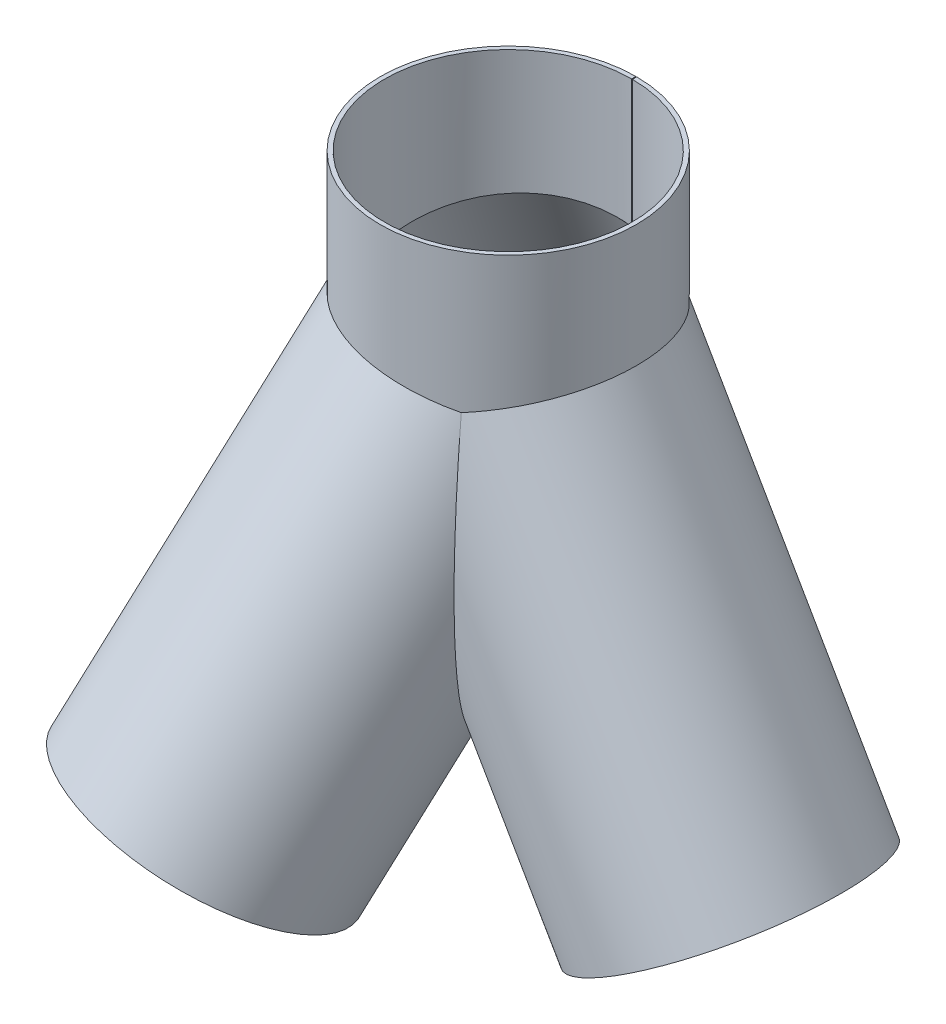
ISO-10303-21;
HEADER;
FILE_DESCRIPTION(('STEP AP214'),'2;1');
FILE_NAME('part.step','',(''),(''),'','','');
FILE_SCHEMA(('AUTOMOTIVE_DESIGN { 1 0 10303 214 1 1 1 1 }'));
ENDSEC;
DATA;
#1=APPLICATION_CONTEXT('core data for automotive mechanical design processes');
#2=APPLICATION_PROTOCOL_DEFINITION('international standard','automotive_design',2000,#1);
#3=PRODUCT_CONTEXT('',#1,'mechanical');
#4=PRODUCT('Part','Part','',(#3));
#5=PRODUCT_RELATED_PRODUCT_CATEGORY('part','',(#4));
#6=PRODUCT_DEFINITION_FORMATION('','',#4);
#7=PRODUCT_DEFINITION_CONTEXT('part definition',#1,'design');
#8=PRODUCT_DEFINITION('design','',#6,#7);
#9=PRODUCT_DEFINITION_SHAPE('','',#8);
#10=(LENGTH_UNIT() NAMED_UNIT(*) SI_UNIT(.MILLI.,.METRE.));
#11=(NAMED_UNIT(*) PLANE_ANGLE_UNIT() SI_UNIT($,.RADIAN.));
#12=(NAMED_UNIT(*) SI_UNIT($,.STERADIAN.) SOLID_ANGLE_UNIT());
#13=UNCERTAINTY_MEASURE_WITH_UNIT(LENGTH_MEASURE(1.E-05),#10,'distance_accuracy_value','');
#14=(GEOMETRIC_REPRESENTATION_CONTEXT(3) GLOBAL_UNCERTAINTY_ASSIGNED_CONTEXT((#13)) GLOBAL_UNIT_ASSIGNED_CONTEXT((#10,
#11,#12)) REPRESENTATION_CONTEXT('',''));
#15=CARTESIAN_POINT('',(0.,0.,0.));
#16=DIRECTION('',(0.,0.,1.));
#17=DIRECTION('',(1.,0.,0.));
#18=AXIS2_PLACEMENT_3D('',#15,#16,#17);
#19=CARTESIAN_POINT('',(0.,0.,0.));
#20=DIRECTION('',(-0.249999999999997,-0.866025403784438,-0.433012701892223));
#21=DIRECTION('',(-0.433012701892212,0.500000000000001,-0.750000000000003));
#22=AXIS2_PLACEMENT_3D('',#19,#20,#21);
#23=CYLINDRICAL_SURFACE('',#22,180.);
#24=DIRECTION('',(-0.249999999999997,-0.866025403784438,-0.433012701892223));
#25=VECTOR('',#24,1.);
#26=CARTESIAN_POINT('',(78.3749983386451,-89.9996527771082,134.749479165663));
#27=LINE('',#26,#25);
#28=CARTESIAN_POINT('',(-77.509574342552,-629.999652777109,-135.25052083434));
#29=VERTEX_POINT('',#28);
#30=CARTESIAN_POINT('',(0.288675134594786,-360.498611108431,-0.499999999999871));
#31=VERTEX_POINT('',#30);
#32=EDGE_CURVE('E68',#29,#31,#27,.F.);
#33=ORIENTED_EDGE('',*,*,#32,.F.);
#34=CARTESIAN_POINT('',(-155.884572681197,-540.,-270.000000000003));
#35=DIRECTION('',(-0.249999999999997,-0.866025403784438,-0.433012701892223));
#36=DIRECTION('',(-0.433012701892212,0.500000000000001,-0.750000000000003));
#37=AXIS2_PLACEMENT_3D('',#34,#35,#36);
#38=CIRCLE('',#37,180.);
#39=CARTESIAN_POINT('',(-78.3755997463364,-629.999652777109,-134.75052083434));
#40=VERTEX_POINT('',#39);
#41=EDGE_CURVE('E126',#40,#29,#38,.T.);
#42=ORIENTED_EDGE('',*,*,#41,.F.);
#43=DIRECTION('',(-0.249999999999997,-0.866025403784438,-0.433012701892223));
#44=VECTOR('',#43,1.);
#45=CARTESIAN_POINT('',(77.5089729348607,-89.9996527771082,135.249479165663));
#46=LINE('',#45,#44);
#47=CARTESIAN_POINT('',(-0.577350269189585,-360.498611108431,0.));
#48=VERTEX_POINT('',#47);
#49=EDGE_CURVE('E107',#40,#48,#46,.F.);
#50=ORIENTED_EDGE('',*,*,#49,.T.);
#51=CARTESIAN_POINT('',(0.,2.22044604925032E-13,0.));
#52=DIRECTION('',(0.,0.,-1.));
#53=DIRECTION('',(-0.277350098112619,-0.960768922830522,0.));
#54=AXIS2_PLACEMENT_3D('',#51,#52,#53);
#55=ELLIPSE('',#54,415.692193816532,180.);
#56=CARTESIAN_POINT('',(-180.,24.1154273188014,-3.38618022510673E-12));
#57=VERTEX_POINT('',#56);
#58=EDGE_CURVE('E143',#57,#48,#55,.F.);
#59=ORIENTED_EDGE('',*,*,#58,.F.);
#60=CARTESIAN_POINT('',(0.,0.,0.));
#61=DIRECTION('',(-0.129409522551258,-0.965925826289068,-0.224143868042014));
#62=DIRECTION('',(-0.482962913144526,0.25881904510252,-0.836516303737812));
#63=AXIS2_PLACEMENT_3D('',#60,#61,#62);
#64=ELLIPSE('',#63,186.349712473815,180.);
#65=CARTESIAN_POINT('',(90.0000000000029,24.1154273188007,-155.884572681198));
#66=VERTEX_POINT('',#65);
#67=EDGE_CURVE('E127',#66,#57,#64,.F.);
#68=ORIENTED_EDGE('',*,*,#67,.F.);
#69=CARTESIAN_POINT('',(0.,2.2204460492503E-13,0.));
#70=DIRECTION('',(0.866025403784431,0.,0.500000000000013));
#71=DIRECTION('',(0.13867504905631,-0.960768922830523,-0.240192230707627));
#72=AXIS2_PLACEMENT_3D('',#69,#70,#71);
#73=ELLIPSE('',#72,415.692193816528,180.);
#74=EDGE_CURVE('E132',#66,#31,#73,.F.);
#75=ORIENTED_EDGE('',*,*,#74,.T.);
#76=EDGE_LOOP('',(#33,#42,#50,#59,#68,#75));
#77=FACE_BOUND('',#76,.T.);
#78=ADVANCED_FACE('F55',(#77),#23,.T.);
#79=CARTESIAN_POINT('',(-1701.82435587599,-540.,-2.99760216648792E-11));
#80=DIRECTION('',(0.,0.,-1.));
#81=DIRECTION('',(-1.,0.,0.));
#82=AXIS2_PLACEMENT_3D('',#79,#80,#81);
#83=PLANE('',#82);
#84=DIRECTION('',(0.,-1.,0.));
#85=VECTOR('',#84,1.);
#86=CARTESIAN_POINT('',(-0.577350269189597,-540.,0.));
#87=LINE('',#86,#85);
#88=CARTESIAN_POINT('',(-0.577350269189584,-348.498563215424,0.));
#89=VERTEX_POINT('',#88);
#90=EDGE_CURVE('E62',#89,#48,#87,.T.);
#91=ORIENTED_EDGE('',*,*,#90,.F.);
#92=CARTESIAN_POINT('',(0.,2.22044604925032E-13,0.));
#93=DIRECTION('',(0.,0.,-1.));
#94=DIRECTION('',(-0.277350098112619,-0.960768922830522,0.));
#95=AXIS2_PLACEMENT_3D('',#92,#93,#94);
#96=ELLIPSE('',#95,401.83578735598,174.);
#97=CARTESIAN_POINT('',(-174.,23.311579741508,-3.24740234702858E-12));
#98=VERTEX_POINT('',#97);
#99=EDGE_CURVE('E122',#98,#89,#96,.F.);
#100=ORIENTED_EDGE('',*,*,#99,.F.);
#101=DIRECTION('',(0.991144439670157,-0.13278817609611,0.));
#102=VECTOR('',#101,1.);
#103=CARTESIAN_POINT('',(1295.83297609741,-173.608699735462,2.26485497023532E-11));
#104=LINE('',#103,#102);
#105=EDGE_CURVE('E148',#57,#98,#104,.T.);
#106=ORIENTED_EDGE('',*,*,#105,.F.);
#107=ORIENTED_EDGE('',*,*,#58,.T.);
#108=EDGE_LOOP('',(#91,#100,#106,#107));
#109=FACE_BOUND('',#108,.T.);
#110=ADVANCED_FACE('F147',(#109),#83,.F.);
#111=CARTESIAN_POINT('',(0.,0.,0.));
#112=DIRECTION('',(-0.249999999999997,-0.866025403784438,-0.433012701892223));
#113=DIRECTION('',(-0.433012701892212,0.500000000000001,-0.750000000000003));
#114=AXIS2_PLACEMENT_3D('',#111,#112,#113);
#115=CYLINDRICAL_SURFACE('',#114,174.);
#116=CARTESIAN_POINT('',(-155.884572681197,-540.,-270.000000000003));
#117=DIRECTION('',(-0.249999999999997,-0.866025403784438,-0.433012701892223));
#118=DIRECTION('',(-0.433012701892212,0.500000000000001,-0.750000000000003));
#119=AXIS2_PLACEMENT_3D('',#116,#117,#118);
#120=CIRCLE('',#119,174.);
#121=CARTESIAN_POINT('',(-80.9736863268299,-626.999640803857,-139.250538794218));
#122=VERTEX_POINT('',#121);
#123=CARTESIAN_POINT('',(-80.1076609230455,-626.999640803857,-139.750538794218));
#124=VERTEX_POINT('',#123);
#125=EDGE_CURVE('E119',#122,#124,#120,.T.);
#126=ORIENTED_EDGE('',*,*,#125,.T.);
#127=DIRECTION('',(-0.249999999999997,-0.866025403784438,-0.433012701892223));
#128=VECTOR('',#127,1.);
#129=CARTESIAN_POINT('',(75.7769117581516,-86.9996408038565,130.249461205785));
#130=LINE('',#129,#128);
#131=CARTESIAN_POINT('',(0.288675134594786,-348.498563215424,-0.499999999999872));
#132=VERTEX_POINT('',#131);
#133=EDGE_CURVE('E144',#124,#132,#130,.F.);
#134=ORIENTED_EDGE('',*,*,#133,.T.);
#135=CARTESIAN_POINT('',(0.,2.2204460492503E-13,0.));
#136=DIRECTION('',(0.866025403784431,0.,0.500000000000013));
#137=DIRECTION('',(0.13867504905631,-0.960768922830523,-0.240192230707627));
#138=AXIS2_PLACEMENT_3D('',#135,#136,#137);
#139=ELLIPSE('',#138,401.835787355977,174.);
#140=CARTESIAN_POINT('',(87.0000000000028,23.3115797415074,-150.688420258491));
#141=VERTEX_POINT('',#140);
#142=EDGE_CURVE('E150',#141,#132,#139,.F.);
#143=ORIENTED_EDGE('',*,*,#142,.F.);
#144=CARTESIAN_POINT('',(0.,0.,0.));
#145=DIRECTION('',(-0.129409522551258,-0.965925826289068,-0.224143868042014));
#146=DIRECTION('',(-0.482962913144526,0.25881904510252,-0.836516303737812));
#147=AXIS2_PLACEMENT_3D('',#144,#145,#146);
#148=ELLIPSE('',#147,180.138055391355,174.);
#149=EDGE_CURVE('E129',#141,#98,#148,.F.);
#150=ORIENTED_EDGE('',*,*,#149,.T.);
#151=ORIENTED_EDGE('',*,*,#99,.T.);
#152=DIRECTION('',(-0.249999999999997,-0.866025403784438,-0.433012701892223));
#153=VECTOR('',#152,1.);
#154=CARTESIAN_POINT('',(74.9108863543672,-86.9996408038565,130.749461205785));
#155=LINE('',#154,#153);
#156=EDGE_CURVE('E76',#122,#89,#155,.F.);
#157=ORIENTED_EDGE('',*,*,#156,.F.);
#158=EDGE_LOOP('',(#126,#134,#143,#150,#151,#157));
#159=FACE_BOUND('',#158,.T.);
#160=ADVANCED_FACE('F117',(#159),#115,.F.);
#161=CARTESIAN_POINT('',(1325.5538408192,48.230854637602,-973.154963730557));
#162=DIRECTION('',(-0.129409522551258,-0.965925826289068,-0.224143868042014));
#163=DIRECTION('',(-0.482962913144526,0.25881904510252,-0.836516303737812));
#164=AXIS2_PLACEMENT_3D('',#161,#162,#163);
#165=PLANE('',#164);
#166=ORIENTED_EDGE('',*,*,#67,.T.);
#167=ORIENTED_EDGE('',*,*,#105,.T.);
#168=ORIENTED_EDGE('',*,*,#149,.F.);
#169=DIRECTION('',(-0.495572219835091,-0.132788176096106,0.858356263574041));
#170=VECTOR('',#169,1.);
#171=CARTESIAN_POINT('',(742.677316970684,198.9997873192,-1286.35484662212));
#172=LINE('',#171,#170);
#173=EDGE_CURVE('E137',#66,#141,#172,.T.);
#174=ORIENTED_EDGE('',*,*,#173,.F.);
#175=EDGE_LOOP('',(#166,#167,#168,#174));
#176=FACE_BOUND('',#175,.T.);
#177=ADVANCED_FACE('F165',(#176),#165,.F.);
#178=CARTESIAN_POINT('',(-155.884572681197,-540.,-270.000000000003));
#179=DIRECTION('',(-0.249999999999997,-0.866025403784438,-0.433012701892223));
#180=DIRECTION('',(-0.433012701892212,0.500000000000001,-0.750000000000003));
#181=AXIS2_PLACEMENT_3D('',#178,#179,#180);
#182=PLANE('',#181);
#183=DIRECTION('',(0.433012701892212,-0.500000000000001,0.750000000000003));
#184=VECTOR('',#183,1.);
#185=CARTESIAN_POINT('',(-155.451559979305,-540.,-270.250000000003));
#186=LINE('',#185,#184);
#187=EDGE_CURVE('E112',#124,#29,#186,.T.);
#188=ORIENTED_EDGE('',*,*,#187,.F.);
#189=ORIENTED_EDGE('',*,*,#125,.F.);
#190=DIRECTION('',(0.433012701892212,-0.500000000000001,0.750000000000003));
#191=VECTOR('',#190,1.);
#192=CARTESIAN_POINT('',(-156.317585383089,-540.,-269.750000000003));
#193=LINE('',#192,#191);
#194=EDGE_CURVE('E104',#122,#40,#193,.T.);
#195=ORIENTED_EDGE('',*,*,#194,.T.);
#196=ORIENTED_EDGE('',*,*,#41,.T.);
#197=EDGE_LOOP('',(#188,#189,#195,#196));
#198=FACE_BOUND('',#197,.T.);
#199=ADVANCED_FACE('F125',(#198),#182,.T.);
#200=CARTESIAN_POINT('',(-802.198248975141,220.,1389.44812496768));
#201=DIRECTION('',(0.866025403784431,0.,0.500000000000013));
#202=DIRECTION('',(0.500000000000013,0.,-0.866025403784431));
#203=AXIS2_PLACEMENT_3D('',#200,#201,#202);
#204=PLANE('',#203);
#205=DIRECTION('',(0.,1.,0.));
#206=VECTOR('',#205,1.);
#207=CARTESIAN_POINT('',(0.288675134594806,220.,-0.499999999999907));
#208=LINE('',#207,#206);
#209=EDGE_CURVE('E13',#31,#132,#208,.T.);
#210=ORIENTED_EDGE('',*,*,#209,.F.);
#211=ORIENTED_EDGE('',*,*,#74,.F.);
#212=ORIENTED_EDGE('',*,*,#173,.T.);
#213=ORIENTED_EDGE('',*,*,#142,.T.);
#214=EDGE_LOOP('',(#210,#211,#212,#213));
#215=FACE_BOUND('',#214,.T.);
#216=ADVANCED_FACE('F159',(#215),#204,.T.);
#217=CARTESIAN_POINT('',(69.698384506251,242.942286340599,121.721143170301));
#218=DIRECTION('',(0.866025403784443,0.,-0.499999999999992));
#219=DIRECTION('',(-0.499999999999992,0.,-0.866025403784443));
#220=AXIS2_PLACEMENT_3D('',#217,#218,#219);
#221=PLANE('',#220);
#222=ORIENTED_EDGE('',*,*,#194,.F.);
#223=ORIENTED_EDGE('',*,*,#156,.T.);
#224=ORIENTED_EDGE('',*,*,#90,.T.);
#225=ORIENTED_EDGE('',*,*,#49,.F.);
#226=EDGE_LOOP('',(#222,#223,#224,#225));
#227=FACE_BOUND('',#226,.T.);
#228=ADVANCED_FACE('F105',(#227),#221,.T.);
#229=CARTESIAN_POINT('',(70.5644099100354,242.942286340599,121.221143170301));
#230=DIRECTION('',(0.866025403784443,0.,-0.499999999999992));
#231=DIRECTION('',(-0.499999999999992,0.,-0.866025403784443));
#232=AXIS2_PLACEMENT_3D('',#229,#230,#231);
#233=PLANE('',#232);
#234=ORIENTED_EDGE('',*,*,#32,.T.);
#235=ORIENTED_EDGE('',*,*,#209,.T.);
#236=ORIENTED_EDGE('',*,*,#133,.F.);
#237=ORIENTED_EDGE('',*,*,#187,.T.);
#238=EDGE_LOOP('',(#234,#235,#236,#237));
#239=FACE_BOUND('',#238,.T.);
#240=ADVANCED_FACE('F161',(#239),#233,.F.);
#241=CLOSED_SHELL('',(#78,#110,#160,#177,#199,#216,#228,#240));
#242=MANIFOLD_SOLID_BREP('B2',#241);
#243=CARTESIAN_POINT('',(0.,0.,0.));
#244=DIRECTION('',(-0.250000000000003,-0.866025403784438,0.433012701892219));
#245=DIRECTION('',(-0.433012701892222,0.500000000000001,0.749999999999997));
#246=AXIS2_PLACEMENT_3D('',#243,#244,#245);
#247=CYLINDRICAL_SURFACE('',#246,180.);
#248=DIRECTION('',(-0.250000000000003,-0.866025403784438,0.433012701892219));
#249=VECTOR('',#248,1.);
#250=CARTESIAN_POINT('',(77.5089729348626,-89.9996527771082,-135.249479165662));
#251=LINE('',#250,#249);
#252=CARTESIAN_POINT('',(-78.3755997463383,-629.999652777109,134.750520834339));
#253=VERTEX_POINT('',#252);
#254=CARTESIAN_POINT('',(-0.577350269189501,-360.498611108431,0.));
#255=VERTEX_POINT('',#254);
#256=EDGE_CURVE('E253',#253,#255,#251,.F.);
#257=ORIENTED_EDGE('',*,*,#256,.F.);
#258=CARTESIAN_POINT('',(-155.884572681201,-540.,270.));
#259=DIRECTION('',(-0.250000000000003,-0.866025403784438,0.433012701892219));
#260=DIRECTION('',(-0.433012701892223,0.500000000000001,0.749999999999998));
#261=AXIS2_PLACEMENT_3D('',#258,#259,#260);
#262=CIRCLE('',#261,180.);
#263=CARTESIAN_POINT('',(-77.5095743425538,-629.999652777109,135.250520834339));
#264=VERTEX_POINT('',#263);
#265=EDGE_CURVE('E311',#264,#253,#262,.T.);
#266=ORIENTED_EDGE('',*,*,#265,.F.);
#267=DIRECTION('',(-0.250000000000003,-0.866025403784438,0.433012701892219));
#268=VECTOR('',#267,1.);
#269=CARTESIAN_POINT('',(78.374998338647,-89.9996527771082,-134.749479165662));
#270=LINE('',#269,#268);
#271=CARTESIAN_POINT('',(0.288675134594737,-360.498611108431,0.499999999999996));
#272=VERTEX_POINT('',#271);
#273=EDGE_CURVE('E292',#264,#272,#270,.F.);
#274=ORIENTED_EDGE('',*,*,#273,.T.);
#275=CARTESIAN_POINT('',(0.,2.22044604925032E-13,0.));
#276=DIRECTION('',(-0.866025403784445,0.,0.499999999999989));
#277=DIRECTION('',(0.138675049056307,-0.960768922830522,0.240192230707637));
#278=AXIS2_PLACEMENT_3D('',#275,#276,#277);
#279=ELLIPSE('',#278,415.692193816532,180.);
#280=CARTESIAN_POINT('',(89.9999999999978,24.1154273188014,155.8845726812));
#281=VERTEX_POINT('',#280);
#282=EDGE_CURVE('E328',#281,#272,#279,.F.);
#283=ORIENTED_EDGE('',*,*,#282,.F.);
#284=CARTESIAN_POINT('',(0.,0.,0.));
#285=DIRECTION('',(-0.129409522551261,-0.965925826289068,0.224143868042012));
#286=DIRECTION('',(-0.482962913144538,0.25881904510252,0.836516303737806));
#287=AXIS2_PLACEMENT_3D('',#284,#285,#286);
#288=ELLIPSE('',#287,186.349712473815,180.);
#289=CARTESIAN_POINT('',(-180.000000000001,24.1154273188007,-2.12330153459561E-12));
#290=VERTEX_POINT('',#289);
#291=EDGE_CURVE('E312',#290,#281,#288,.F.);
#292=ORIENTED_EDGE('',*,*,#291,.F.);
#293=CARTESIAN_POINT('',(0.,2.2204460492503E-13,0.));
#294=DIRECTION('',(0.,0.,-1.));
#295=DIRECTION('',(-0.277350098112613,-0.960768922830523,0.));
#296=AXIS2_PLACEMENT_3D('',#293,#294,#295);
#297=ELLIPSE('',#296,415.692193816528,180.);
#298=EDGE_CURVE('E317',#290,#255,#297,.F.);
#299=ORIENTED_EDGE('',*,*,#298,.T.);
#300=EDGE_LOOP('',(#257,#266,#274,#283,#292,#299));
#301=FACE_BOUND('',#300,.T.);
#302=ADVANCED_FACE('F240',(#301),#247,.T.);
#303=CARTESIAN_POINT('',(850.912177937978,-540.,1473.82312496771));
#304=DIRECTION('',(-0.866025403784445,0.,0.499999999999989));
#305=DIRECTION('',(0.499999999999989,0.,0.866025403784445));
#306=AXIS2_PLACEMENT_3D('',#303,#304,#305);
#307=PLANE('',#306);
#308=DIRECTION('',(0.,-1.,0.));
#309=VECTOR('',#308,1.);
#310=CARTESIAN_POINT('',(0.288675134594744,-540.,0.500000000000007));
#311=LINE('',#310,#309);
#312=CARTESIAN_POINT('',(0.288675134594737,-348.498563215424,0.499999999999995));
#313=VERTEX_POINT('',#312);
#314=EDGE_CURVE('E247',#313,#272,#311,.T.);
#315=ORIENTED_EDGE('',*,*,#314,.F.);
#316=CARTESIAN_POINT('',(0.,2.22044604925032E-13,0.));
#317=DIRECTION('',(-0.866025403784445,0.,0.499999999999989));
#318=DIRECTION('',(0.138675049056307,-0.960768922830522,0.240192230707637));
#319=AXIS2_PLACEMENT_3D('',#316,#317,#318);
#320=ELLIPSE('',#319,401.83578735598,174.);
#321=CARTESIAN_POINT('',(86.9999999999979,23.311579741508,150.688420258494));
#322=VERTEX_POINT('',#321);
#323=EDGE_CURVE('E307',#322,#313,#320,.F.);
#324=ORIENTED_EDGE('',*,*,#323,.F.);
#325=DIRECTION('',(-0.495572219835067,-0.13278817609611,-0.858356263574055));
#326=VECTOR('',#325,1.);
#327=CARTESIAN_POINT('',(-647.916488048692,-173.608699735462,-1122.22427636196));
#328=LINE('',#327,#326);
#329=EDGE_CURVE('E333',#281,#322,#328,.T.);
#330=ORIENTED_EDGE('',*,*,#329,.F.);
#331=ORIENTED_EDGE('',*,*,#282,.T.);
#332=EDGE_LOOP('',(#315,#324,#330,#331));
#333=FACE_BOUND('',#332,.T.);
#334=ADVANCED_FACE('F332',(#333),#307,.F.);
#335=CARTESIAN_POINT('',(0.,0.,0.));
#336=DIRECTION('',(-0.250000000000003,-0.866025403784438,0.433012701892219));
#337=DIRECTION('',(-0.433012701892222,0.500000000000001,0.749999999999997));
#338=AXIS2_PLACEMENT_3D('',#335,#336,#337);
#339=CYLINDRICAL_SURFACE('',#338,174.);
#340=CARTESIAN_POINT('',(-155.884572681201,-540.,270.));
#341=DIRECTION('',(-0.250000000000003,-0.866025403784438,0.433012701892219));
#342=DIRECTION('',(-0.433012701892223,0.500000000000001,0.749999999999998));
#343=AXIS2_PLACEMENT_3D('',#340,#341,#342);
#344=CIRCLE('',#343,174.);
#345=CARTESIAN_POINT('',(-80.1076609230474,-626.999640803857,139.750538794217));
#346=VERTEX_POINT('',#345);
#347=CARTESIAN_POINT('',(-80.9736863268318,-626.999640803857,139.250538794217));
#348=VERTEX_POINT('',#347);
#349=EDGE_CURVE('E304',#346,#348,#344,.T.);
#350=ORIENTED_EDGE('',*,*,#349,.T.);
#351=DIRECTION('',(-0.250000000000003,-0.866025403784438,0.433012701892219));
#352=VECTOR('',#351,1.);
#353=CARTESIAN_POINT('',(74.9108863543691,-86.9996408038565,-130.749461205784));
#354=LINE('',#353,#352);
#355=CARTESIAN_POINT('',(-0.577350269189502,-348.498563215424,0.));
#356=VERTEX_POINT('',#355);
#357=EDGE_CURVE('E329',#348,#356,#354,.F.);
#358=ORIENTED_EDGE('',*,*,#357,.T.);
#359=CARTESIAN_POINT('',(0.,2.2204460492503E-13,0.));
#360=DIRECTION('',(0.,0.,-1.));
#361=DIRECTION('',(-0.277350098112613,-0.960768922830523,0.));
#362=AXIS2_PLACEMENT_3D('',#359,#360,#361);
#363=ELLIPSE('',#362,401.835787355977,174.);
#364=CARTESIAN_POINT('',(-174.000000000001,23.3115797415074,-2.09554595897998E-12));
#365=VERTEX_POINT('',#364);
#366=EDGE_CURVE('E335',#365,#356,#363,.F.);
#367=ORIENTED_EDGE('',*,*,#366,.F.);
#368=CARTESIAN_POINT('',(0.,0.,0.));
#369=DIRECTION('',(-0.129409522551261,-0.965925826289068,0.224143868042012));
#370=DIRECTION('',(-0.482962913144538,0.25881904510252,0.836516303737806));
#371=AXIS2_PLACEMENT_3D('',#368,#369,#370);
#372=ELLIPSE('',#371,180.138055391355,174.);
#373=EDGE_CURVE('E314',#365,#322,#372,.F.);
#374=ORIENTED_EDGE('',*,*,#373,.T.);
#375=ORIENTED_EDGE('',*,*,#323,.T.);
#376=DIRECTION('',(-0.250000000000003,-0.866025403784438,0.433012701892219));
#377=VECTOR('',#376,1.);
#378=CARTESIAN_POINT('',(75.7769117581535,-86.9996408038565,-130.249461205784));
#379=LINE('',#378,#377);
#380=EDGE_CURVE('E261',#346,#313,#379,.F.);
#381=ORIENTED_EDGE('',*,*,#380,.F.);
#382=EDGE_LOOP('',(#350,#358,#367,#374,#375,#381));
#383=FACE_BOUND('',#382,.T.);
#384=ADVANCED_FACE('F302',(#383),#339,.F.);
#385=CARTESIAN_POINT('',(-1505.55384081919,48.230854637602,-661.385818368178));
#386=DIRECTION('',(-0.129409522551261,-0.965925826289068,0.224143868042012));
#387=DIRECTION('',(-0.482962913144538,0.25881904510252,0.836516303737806));
#388=AXIS2_PLACEMENT_3D('',#385,#386,#387);
#389=PLANE('',#388);
#390=ORIENTED_EDGE('',*,*,#291,.T.);
#391=ORIENTED_EDGE('',*,*,#329,.T.);
#392=ORIENTED_EDGE('',*,*,#373,.F.);
#393=DIRECTION('',(0.991144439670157,-0.132788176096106,0.));
#394=VECTOR('',#393,1.);
#395=CARTESIAN_POINT('',(-1485.35463394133,198.9997873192,-1.59872115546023E-11));
#396=LINE('',#395,#394);
#397=EDGE_CURVE('E322',#290,#365,#396,.T.);
#398=ORIENTED_EDGE('',*,*,#397,.F.);
#399=EDGE_LOOP('',(#390,#391,#392,#398));
#400=FACE_BOUND('',#399,.T.);
#401=ADVANCED_FACE('F350',(#400),#389,.F.);
#402=CARTESIAN_POINT('',(-155.884572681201,-540.,270.));
#403=DIRECTION('',(-0.250000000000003,-0.866025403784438,0.433012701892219));
#404=DIRECTION('',(-0.433012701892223,0.500000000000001,0.749999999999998));
#405=AXIS2_PLACEMENT_3D('',#402,#403,#404);
#406=PLANE('',#405);
#407=DIRECTION('',(0.433012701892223,-0.500000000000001,-0.749999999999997));
#408=VECTOR('',#407,1.);
#409=CARTESIAN_POINT('',(-156.317585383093,-540.,269.75));
#410=LINE('',#409,#408);
#411=EDGE_CURVE('E297',#348,#253,#410,.T.);
#412=ORIENTED_EDGE('',*,*,#411,.F.);
#413=ORIENTED_EDGE('',*,*,#349,.F.);
#414=DIRECTION('',(0.433012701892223,-0.500000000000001,-0.749999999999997));
#415=VECTOR('',#414,1.);
#416=CARTESIAN_POINT('',(-155.451559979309,-540.,270.25));
#417=LINE('',#416,#415);
#418=EDGE_CURVE('E289',#346,#264,#417,.T.);
#419=ORIENTED_EDGE('',*,*,#418,.T.);
#420=ORIENTED_EDGE('',*,*,#265,.T.);
#421=EDGE_LOOP('',(#412,#413,#419,#420));
#422=FACE_BOUND('',#421,.T.);
#423=ADVANCED_FACE('F310',(#422),#406,.T.);
#424=CARTESIAN_POINT('',(1604.39649795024,220.,1.67643676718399E-11));
#425=DIRECTION('',(0.,0.,-1.));
#426=DIRECTION('',(-1.,0.,0.));
#427=AXIS2_PLACEMENT_3D('',#424,#425,#426);
#428=PLANE('',#427);
#429=DIRECTION('',(0.,1.,0.));
#430=VECTOR('',#429,1.);
#431=CARTESIAN_POINT('',(-0.577350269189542,220.,0.));
#432=LINE('',#431,#430);
#433=EDGE_CURVE('E53',#255,#356,#432,.T.);
#434=ORIENTED_EDGE('',*,*,#433,.F.);
#435=ORIENTED_EDGE('',*,*,#298,.F.);
#436=ORIENTED_EDGE('',*,*,#397,.T.);
#437=ORIENTED_EDGE('',*,*,#366,.T.);
#438=EDGE_LOOP('',(#434,#435,#436,#437));
#439=FACE_BOUND('',#438,.T.);
#440=ADVANCED_FACE('F344',(#439),#428,.T.);
#441=CARTESIAN_POINT('',(70.5644099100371,242.942286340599,-121.2211431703));
#442=DIRECTION('',(-0.866025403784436,0.,-0.500000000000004));
#443=DIRECTION('',(-0.500000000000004,0.,0.866025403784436));
#444=AXIS2_PLACEMENT_3D('',#441,#442,#443);
#445=PLANE('',#444);
#446=ORIENTED_EDGE('',*,*,#418,.F.);
#447=ORIENTED_EDGE('',*,*,#380,.T.);
#448=ORIENTED_EDGE('',*,*,#314,.T.);
#449=ORIENTED_EDGE('',*,*,#273,.F.);
#450=EDGE_LOOP('',(#446,#447,#448,#449));
#451=FACE_BOUND('',#450,.T.);
#452=ADVANCED_FACE('F290',(#451),#445,.T.);
#453=CARTESIAN_POINT('',(69.6983845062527,242.942286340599,-121.7211431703));
#454=DIRECTION('',(-0.866025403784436,0.,-0.500000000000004));
#455=DIRECTION('',(-0.500000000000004,0.,0.866025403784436));
#456=AXIS2_PLACEMENT_3D('',#453,#454,#455);
#457=PLANE('',#456);
#458=ORIENTED_EDGE('',*,*,#256,.T.);
#459=ORIENTED_EDGE('',*,*,#433,.T.);
#460=ORIENTED_EDGE('',*,*,#357,.F.);
#461=ORIENTED_EDGE('',*,*,#411,.T.);
#462=EDGE_LOOP('',(#458,#459,#460,#461));
#463=FACE_BOUND('',#462,.T.);
#464=ADVANCED_FACE('F346',(#463),#457,.F.);
#465=CLOSED_SHELL('',(#302,#334,#384,#401,#423,#440,#452,#464));
#466=MANIFOLD_SOLID_BREP('B7',#465);
#467=CARTESIAN_POINT('',(0.,0.,0.));
#468=DIRECTION('',(0.500000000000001,-0.866025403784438,0.));
#469=DIRECTION('',(0.866025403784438,0.500000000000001,0.));
#470=AXIS2_PLACEMENT_3D('',#467,#468,#469);
#471=CYLINDRICAL_SURFACE('',#470,180.);
#472=DIRECTION('',(0.500000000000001,-0.866025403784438,0.));
#473=VECTOR('',#472,1.);
#474=CARTESIAN_POINT('',(-155.883971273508,-89.9996527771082,0.499999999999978));
#475=LINE('',#474,#473);
#476=CARTESIAN_POINT('',(155.885174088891,-629.999652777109,0.499999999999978));
#477=VERTEX_POINT('',#476);
#478=CARTESIAN_POINT('',(0.28867513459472,-360.498611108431,0.499999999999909));
#479=VERTEX_POINT('',#478);
#480=EDGE_CURVE('E437',#477,#479,#475,.F.);
#481=ORIENTED_EDGE('',*,*,#480,.F.);
#482=CARTESIAN_POINT('',(311.769145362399,-540.,0.));
#483=DIRECTION('',(0.500000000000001,-0.866025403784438,0.));
#484=DIRECTION('',(0.866025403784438,0.500000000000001,0.));
#485=AXIS2_PLACEMENT_3D('',#482,#483,#484);
#486=CIRCLE('',#485,180.);
#487=CARTESIAN_POINT('',(155.885174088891,-629.999652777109,-0.500000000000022));
#488=VERTEX_POINT('',#487);
#489=EDGE_CURVE('E495',#488,#477,#486,.T.);
#490=ORIENTED_EDGE('',*,*,#489,.F.);
#491=DIRECTION('',(0.500000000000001,-0.866025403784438,0.));
#492=VECTOR('',#491,1.);
#493=CARTESIAN_POINT('',(-155.883971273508,-89.9996527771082,-0.500000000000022));
#494=LINE('',#493,#492);
#495=CARTESIAN_POINT('',(0.288675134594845,-360.498611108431,-0.499999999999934));
#496=VERTEX_POINT('',#495);
#497=EDGE_CURVE('E476',#488,#496,#494,.F.);
#498=ORIENTED_EDGE('',*,*,#497,.T.);
#499=CARTESIAN_POINT('',(0.,2.22044604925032E-13,0.));
#500=DIRECTION('',(0.866025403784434,0.,0.500000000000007));
#501=DIRECTION('',(0.138675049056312,-0.960768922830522,-0.240192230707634));
#502=AXIS2_PLACEMENT_3D('',#499,#500,#501);
#503=ELLIPSE('',#502,415.692193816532,180.);
#504=CARTESIAN_POINT('',(90.0000000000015,24.1154273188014,-155.884572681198));
#505=VERTEX_POINT('',#504);
#506=EDGE_CURVE('E512',#505,#496,#503,.F.);
#507=ORIENTED_EDGE('',*,*,#506,.F.);
#508=CARTESIAN_POINT('',(0.,0.,0.));
#509=DIRECTION('',(0.25881904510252,-0.965925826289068,0.));
#510=DIRECTION('',(0.965925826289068,0.25881904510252,0.));
#511=AXIS2_PLACEMENT_3D('',#508,#509,#510);
#512=ELLIPSE('',#511,186.349712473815,180.);
#513=CARTESIAN_POINT('',(89.9999999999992,24.1154273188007,155.8845726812));
#514=VERTEX_POINT('',#513);
#515=EDGE_CURVE('E496',#514,#505,#512,.F.);
#516=ORIENTED_EDGE('',*,*,#515,.F.);
#517=CARTESIAN_POINT('',(0.,2.2204460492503E-13,0.));
#518=DIRECTION('',(-0.866025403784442,0.,0.499999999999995));
#519=DIRECTION('',(0.138675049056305,-0.960768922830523,0.24019223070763));
#520=AXIS2_PLACEMENT_3D('',#517,#518,#519);
#521=ELLIPSE('',#520,415.692193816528,180.);
#522=EDGE_CURVE('E501',#514,#479,#521,.F.);
#523=ORIENTED_EDGE('',*,*,#522,.T.);
#524=EDGE_LOOP('',(#481,#490,#498,#507,#516,#523));
#525=FACE_BOUND('',#524,.T.);
#526=ADVANCED_FACE('F424',(#525),#471,.T.);
#527=CARTESIAN_POINT('',(850.912177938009,-540.,-1473.82312496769));
#528=DIRECTION('',(0.866025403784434,0.,0.500000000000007));
#529=DIRECTION('',(0.500000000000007,0.,-0.866025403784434));
#530=AXIS2_PLACEMENT_3D('',#527,#528,#529);
#531=PLANE('',#530);
#532=DIRECTION('',(0.,-1.,0.));
#533=VECTOR('',#532,1.);
#534=CARTESIAN_POINT('',(0.288675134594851,-540.,-0.499999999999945));
#535=LINE('',#534,#533);
#536=CARTESIAN_POINT('',(0.288675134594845,-348.498563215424,-0.499999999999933));
#537=VERTEX_POINT('',#536);
#538=EDGE_CURVE('E431',#537,#496,#535,.T.);
#539=ORIENTED_EDGE('',*,*,#538,.F.);
#540=CARTESIAN_POINT('',(0.,2.22044604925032E-13,0.));
#541=DIRECTION('',(0.866025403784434,0.,0.500000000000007));
#542=DIRECTION('',(0.138675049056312,-0.960768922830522,-0.240192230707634));
#543=AXIS2_PLACEMENT_3D('',#540,#541,#542);
#544=ELLIPSE('',#543,401.83578735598,174.);
#545=CARTESIAN_POINT('',(87.0000000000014,23.311579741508,-150.688420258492));
#546=VERTEX_POINT('',#545);
#547=EDGE_CURVE('E491',#546,#537,#544,.F.);
#548=ORIENTED_EDGE('',*,*,#547,.F.);
#549=DIRECTION('',(-0.495572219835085,-0.13278817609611,0.858356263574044));
#550=VECTOR('',#549,1.);
#551=CARTESIAN_POINT('',(-647.916488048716,-173.608699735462,1122.22427636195));
#552=LINE('',#551,#550);
#553=EDGE_CURVE('E517',#505,#546,#552,.T.);
#554=ORIENTED_EDGE('',*,*,#553,.F.);
#555=ORIENTED_EDGE('',*,*,#506,.T.);
#556=EDGE_LOOP('',(#539,#548,#554,#555));
#557=FACE_BOUND('',#556,.T.);
#558=ADVANCED_FACE('F516',(#557),#531,.F.);
#559=CARTESIAN_POINT('',(0.,0.,0.));
#560=DIRECTION('',(0.500000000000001,-0.866025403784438,0.));
#561=DIRECTION('',(0.866025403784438,0.500000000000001,0.));
#562=AXIS2_PLACEMENT_3D('',#559,#560,#561);
#563=CYLINDRICAL_SURFACE('',#562,174.);
#564=CARTESIAN_POINT('',(311.769145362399,-540.,0.));
#565=DIRECTION('',(0.500000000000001,-0.866025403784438,0.));
#566=DIRECTION('',(0.866025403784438,0.500000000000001,0.));
#567=AXIS2_PLACEMENT_3D('',#564,#565,#566);
#568=CIRCLE('',#567,174.);
#569=CARTESIAN_POINT('',(161.081347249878,-626.999640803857,-0.500000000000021));
#570=VERTEX_POINT('',#569);
#571=CARTESIAN_POINT('',(161.081347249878,-626.999640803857,0.499999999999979));
#572=VERTEX_POINT('',#571);
#573=EDGE_CURVE('E488',#570,#572,#568,.T.);
#574=ORIENTED_EDGE('',*,*,#573,.T.);
#575=DIRECTION('',(0.500000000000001,-0.866025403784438,0.));
#576=VECTOR('',#575,1.);
#577=CARTESIAN_POINT('',(-150.687798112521,-86.9996408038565,0.499999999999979));
#578=LINE('',#577,#576);
#579=CARTESIAN_POINT('',(0.28867513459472,-348.498563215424,0.49999999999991));
#580=VERTEX_POINT('',#579);
#581=EDGE_CURVE('E513',#572,#580,#578,.F.);
#582=ORIENTED_EDGE('',*,*,#581,.T.);
#583=CARTESIAN_POINT('',(0.,2.2204460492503E-13,0.));
#584=DIRECTION('',(-0.866025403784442,0.,0.499999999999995));
#585=DIRECTION('',(0.138675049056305,-0.960768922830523,0.24019223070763));
#586=AXIS2_PLACEMENT_3D('',#583,#584,#585);
#587=ELLIPSE('',#586,401.835787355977,174.);
#588=CARTESIAN_POINT('',(86.9999999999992,23.3115797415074,150.688420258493));
#589=VERTEX_POINT('',#588);
#590=EDGE_CURVE('E519',#589,#580,#587,.F.);
#591=ORIENTED_EDGE('',*,*,#590,.F.);
#592=CARTESIAN_POINT('',(0.,0.,0.));
#593=DIRECTION('',(0.25881904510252,-0.965925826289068,0.));
#594=DIRECTION('',(0.965925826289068,0.25881904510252,0.));
#595=AXIS2_PLACEMENT_3D('',#592,#593,#594);
#596=ELLIPSE('',#595,180.138055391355,174.);
#597=EDGE_CURVE('E498',#589,#546,#596,.F.);
#598=ORIENTED_EDGE('',*,*,#597,.T.);
#599=ORIENTED_EDGE('',*,*,#547,.T.);
#600=DIRECTION('',(0.500000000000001,-0.866025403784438,0.));
#601=VECTOR('',#600,1.);
#602=CARTESIAN_POINT('',(-150.687798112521,-86.9996408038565,-0.500000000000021));
#603=LINE('',#602,#601);
#604=EDGE_CURVE('E445',#570,#537,#603,.F.);
#605=ORIENTED_EDGE('',*,*,#604,.F.);
#606=EDGE_LOOP('',(#574,#582,#591,#598,#599,#605));
#607=FACE_BOUND('',#606,.T.);
#608=ADVANCED_FACE('F486',(#607),#563,.F.);
#609=CARTESIAN_POINT('',(180.,48.230854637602,1634.54078209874));
#610=DIRECTION('',(0.25881904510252,-0.965925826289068,0.));
#611=DIRECTION('',(0.965925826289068,0.25881904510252,0.));
#612=AXIS2_PLACEMENT_3D('',#609,#610,#611);
#613=PLANE('',#612);
#614=ORIENTED_EDGE('',*,*,#515,.T.);
#615=ORIENTED_EDGE('',*,*,#553,.T.);
#616=ORIENTED_EDGE('',*,*,#597,.F.);
#617=DIRECTION('',(-0.495572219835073,-0.132788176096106,-0.858356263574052));
#618=VECTOR('',#617,1.);
#619=CARTESIAN_POINT('',(742.677316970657,198.9997873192,1286.35484662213));
#620=LINE('',#619,#618);
#621=EDGE_CURVE('E506',#514,#589,#620,.T.);
#622=ORIENTED_EDGE('',*,*,#621,.F.);
#623=EDGE_LOOP('',(#614,#615,#616,#622));
#624=FACE_BOUND('',#623,.T.);
#625=ADVANCED_FACE('F534',(#624),#613,.F.);
#626=CARTESIAN_POINT('',(311.769145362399,-540.,0.));
#627=DIRECTION('',(0.500000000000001,-0.866025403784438,0.));
#628=DIRECTION('',(0.866025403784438,0.500000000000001,0.));
#629=AXIS2_PLACEMENT_3D('',#626,#627,#628);
#630=PLANE('',#629);
#631=DIRECTION('',(-0.866025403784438,-0.500000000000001,0.));
#632=VECTOR('',#631,1.);
#633=CARTESIAN_POINT('',(311.769145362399,-540.,0.5));
#634=LINE('',#633,#632);
#635=EDGE_CURVE('E481',#572,#477,#634,.T.);
#636=ORIENTED_EDGE('',*,*,#635,.F.);
#637=ORIENTED_EDGE('',*,*,#573,.F.);
#638=DIRECTION('',(-0.866025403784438,-0.500000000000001,0.));
#639=VECTOR('',#638,1.);
#640=CARTESIAN_POINT('',(311.769145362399,-540.,-0.5));
#641=LINE('',#640,#639);
#642=EDGE_CURVE('E473',#570,#488,#641,.T.);
#643=ORIENTED_EDGE('',*,*,#642,.T.);
#644=ORIENTED_EDGE('',*,*,#489,.T.);
#645=EDGE_LOOP('',(#636,#637,#643,#644));
#646=FACE_BOUND('',#645,.T.);
#647=ADVANCED_FACE('F494',(#646),#630,.T.);
#648=CARTESIAN_POINT('',(-802.198248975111,220.,-1389.4481249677));
#649=DIRECTION('',(-0.866025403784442,0.,0.499999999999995));
#650=DIRECTION('',(0.499999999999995,0.,0.866025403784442));
#651=AXIS2_PLACEMENT_3D('',#648,#649,#650);
#652=PLANE('',#651);
#653=DIRECTION('',(0.,1.,0.));
#654=VECTOR('',#653,1.);
#655=CARTESIAN_POINT('',(0.28867513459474,220.,0.499999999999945));
#656=LINE('',#655,#654);
#657=EDGE_CURVE('E238',#479,#580,#656,.T.);
#658=ORIENTED_EDGE('',*,*,#657,.F.);
#659=ORIENTED_EDGE('',*,*,#522,.F.);
#660=ORIENTED_EDGE('',*,*,#621,.T.);
#661=ORIENTED_EDGE('',*,*,#590,.T.);
#662=EDGE_LOOP('',(#658,#659,#660,#661));
#663=FACE_BOUND('',#662,.T.);
#664=ADVANCED_FACE('F528',(#663),#652,.T.);
#665=CARTESIAN_POINT('',(-140.262794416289,242.942286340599,-0.5));
#666=DIRECTION('',(0.,0.,1.));
#667=DIRECTION('',(1.,0.,0.));
#668=AXIS2_PLACEMENT_3D('',#665,#666,#667);
#669=PLANE('',#668);
#670=ORIENTED_EDGE('',*,*,#642,.F.);
#671=ORIENTED_EDGE('',*,*,#604,.T.);
#672=ORIENTED_EDGE('',*,*,#538,.T.);
#673=ORIENTED_EDGE('',*,*,#497,.F.);
#674=EDGE_LOOP('',(#670,#671,#672,#673));
#675=FACE_BOUND('',#674,.T.);
#676=ADVANCED_FACE('F474',(#675),#669,.T.);
#677=CARTESIAN_POINT('',(-140.262794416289,242.942286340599,0.5));
#678=DIRECTION('',(0.,0.,1.));
#679=DIRECTION('',(1.,0.,0.));
#680=AXIS2_PLACEMENT_3D('',#677,#678,#679);
#681=PLANE('',#680);
#682=ORIENTED_EDGE('',*,*,#480,.T.);
#683=ORIENTED_EDGE('',*,*,#657,.T.);
#684=ORIENTED_EDGE('',*,*,#581,.F.);
#685=ORIENTED_EDGE('',*,*,#635,.T.);
#686=EDGE_LOOP('',(#682,#683,#684,#685));
#687=FACE_BOUND('',#686,.T.);
#688=ADVANCED_FACE('F530',(#687),#681,.F.);
#689=CLOSED_SHELL('',(#526,#558,#608,#625,#647,#664,#676,#688));
#690=MANIFOLD_SOLID_BREP('B47',#689);
#691=CARTESIAN_POINT('',(0.,220.,0.));
#692=DIRECTION('',(0.,-1.,0.));
#693=DIRECTION('',(0.,0.,-1.));
#694=AXIS2_PLACEMENT_3D('',#691,#692,#693);
#695=CYLINDRICAL_SURFACE('',#694,180.);
#696=CARTESIAN_POINT('',(0.,0.,0.));
#697=DIRECTION('',(-0.129409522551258,-0.965925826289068,-0.224143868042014));
#698=DIRECTION('',(0.482962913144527,-0.25881904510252,0.836516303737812));
#699=AXIS2_PLACEMENT_3D('',#696,#697,#698);
#700=ELLIPSE('',#699,186.349712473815,180.);
#701=CARTESIAN_POINT('',(0.499999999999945,41.7019969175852,-179.999305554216));
#702=VERTEX_POINT('',#701);
#703=CARTESIAN_POINT('',(90.0000000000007,24.1154273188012,-155.884572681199));
#704=VERTEX_POINT('',#703);
#705=EDGE_CURVE('E699',#702,#704,#700,.T.);
#706=ORIENTED_EDGE('',*,*,#705,.F.);
#707=DIRECTION('',(0.,-1.,0.));
#708=VECTOR('',#707,1.);
#709=CARTESIAN_POINT('',(0.5,220.,-179.999305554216));
#710=LINE('',#709,#708);
#711=CARTESIAN_POINT('',(0.5,220.,-179.999305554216));
#712=VERTEX_POINT('',#711);
#713=EDGE_CURVE('E709',#702,#712,#710,.F.);
#714=ORIENTED_EDGE('',*,*,#713,.T.);
#715=CARTESIAN_POINT('',(0.,220.,0.));
#716=DIRECTION('',(0.,1.,0.));
#717=DIRECTION('',(0.,0.,1.));
#718=AXIS2_PLACEMENT_3D('',#715,#716,#717);
#719=CIRCLE('',#718,180.);
#720=CARTESIAN_POINT('',(-0.5,220.,-179.999305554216));
#721=VERTEX_POINT('',#720);
#722=EDGE_CURVE('E673',#721,#712,#719,.T.);
#723=ORIENTED_EDGE('',*,*,#722,.F.);
#724=DIRECTION('',(0.,-1.,0.));
#725=VECTOR('',#724,1.);
#726=CARTESIAN_POINT('',(-0.5,220.,-179.999305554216));
#727=LINE('',#726,#725);
#728=CARTESIAN_POINT('',(-0.499999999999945,41.8359715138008,-179.999305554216));
#729=VERTEX_POINT('',#728);
#730=EDGE_CURVE('E620',#729,#721,#727,.F.);
#731=ORIENTED_EDGE('',*,*,#730,.F.);
#732=CARTESIAN_POINT('',(-179.999999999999,24.1154273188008,-1.26517968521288E-12));
#733=VERTEX_POINT('',#732);
#734=EDGE_CURVE('E679',#733,#729,#700,.T.);
#735=ORIENTED_EDGE('',*,*,#734,.F.);
#736=CARTESIAN_POINT('',(0.,0.,0.));
#737=DIRECTION('',(-0.129409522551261,-0.965925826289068,0.224143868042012));
#738=DIRECTION('',(0.482962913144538,-0.25881904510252,-0.836516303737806));
#739=AXIS2_PLACEMENT_3D('',#736,#737,#738);
#740=ELLIPSE('',#739,186.349712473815,180.);
#741=CARTESIAN_POINT('',(89.9999999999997,24.1154273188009,155.884572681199));
#742=VERTEX_POINT('',#741);
#743=EDGE_CURVE('E698',#742,#733,#740,.T.);
#744=ORIENTED_EDGE('',*,*,#743,.F.);
#745=CARTESIAN_POINT('',(0.,0.,0.));
#746=DIRECTION('',(0.25881904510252,-0.965925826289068,0.));
#747=DIRECTION('',(-0.965925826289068,-0.25881904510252,0.));
#748=AXIS2_PLACEMENT_3D('',#745,#746,#747);
#749=ELLIPSE('',#748,186.349712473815,180.);
#750=EDGE_CURVE('E674',#704,#742,#749,.T.);
#751=ORIENTED_EDGE('',*,*,#750,.F.);
#752=EDGE_LOOP('',(#706,#714,#723,#731,#735,#744,#751));
#753=FACE_BOUND('',#752,.T.);
#754=ADVANCED_FACE('F599',(#753),#695,.T.);
#755=CARTESIAN_POINT('',(1299.4481249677,48.230854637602,-958.082821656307));
#756=DIRECTION('',(-0.129409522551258,-0.965925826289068,-0.224143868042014));
#757=DIRECTION('',(0.,0.226044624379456,-0.974116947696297));
#758=AXIS2_PLACEMENT_3D('',#755,#756,#757);
#759=PLANE('',#758);
#760=ORIENTED_EDGE('',*,*,#734,.T.);
#761=DIRECTION('',(0.,-0.226044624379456,0.974116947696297));
#762=VECTOR('',#761,1.);
#763=CARTESIAN_POINT('',(-0.499999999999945,213.491969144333,-919.733846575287));
#764=LINE('',#763,#762);
#765=CARTESIAN_POINT('',(-0.499999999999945,40.4436611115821,-173.999281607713));
#766=VERTEX_POINT('',#765);
#767=EDGE_CURVE('E670',#729,#766,#764,.T.);
#768=ORIENTED_EDGE('',*,*,#767,.T.);
#769=CARTESIAN_POINT('',(0.,0.,0.));
#770=DIRECTION('',(-0.129409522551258,-0.965925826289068,-0.224143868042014));
#771=DIRECTION('',(0.482962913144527,-0.25881904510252,0.836516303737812));
#772=AXIS2_PLACEMENT_3D('',#769,#770,#771);
#773=ELLIPSE('',#772,180.138055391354,174.);
#774=CARTESIAN_POINT('',(-174.,23.3115797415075,-1.22365702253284E-12));
#775=VERTEX_POINT('',#774);
#776=EDGE_CURVE('E669',#775,#766,#773,.T.);
#777=ORIENTED_EDGE('',*,*,#776,.F.);
#778=DIRECTION('',(-0.991144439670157,0.132788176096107,0.));
#779=VECTOR('',#778,1.);
#780=CARTESIAN_POINT('',(1270.18757449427,-170.172867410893,8.77076189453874E-12));
#781=LINE('',#780,#779);
#782=EDGE_CURVE('E661',#775,#733,#781,.T.);
#783=ORIENTED_EDGE('',*,*,#782,.T.);
#784=EDGE_LOOP('',(#760,#768,#777,#783));
#785=FACE_BOUND('',#784,.T.);
#786=ADVANCED_FACE('F692',(#785),#759,.T.);
#787=CARTESIAN_POINT('',(0.,220.,0.));
#788=DIRECTION('',(0.,-1.,0.));
#789=DIRECTION('',(0.,0.,-1.));
#790=AXIS2_PLACEMENT_3D('',#787,#788,#789);
#791=CYLINDRICAL_SURFACE('',#790,174.);
#792=DIRECTION('',(0.,-1.,0.));
#793=VECTOR('',#792,1.);
#794=CARTESIAN_POINT('',(0.5,220.,-173.999281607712));
#795=LINE('',#794,#793);
#796=CARTESIAN_POINT('',(0.499999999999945,40.3096865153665,-173.999281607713));
#797=VERTEX_POINT('',#796);
#798=CARTESIAN_POINT('',(0.5,220.,-173.999281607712));
#799=VERTEX_POINT('',#798);
#800=EDGE_CURVE('E612',#797,#799,#795,.F.);
#801=ORIENTED_EDGE('',*,*,#800,.F.);
#802=CARTESIAN_POINT('',(87.0000000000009,23.3115797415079,-150.688420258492));
#803=VERTEX_POINT('',#802);
#804=EDGE_CURVE('E702',#797,#803,#773,.T.);
#805=ORIENTED_EDGE('',*,*,#804,.T.);
#806=CARTESIAN_POINT('',(0.,0.,0.));
#807=DIRECTION('',(0.25881904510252,-0.965925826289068,0.));
#808=DIRECTION('',(-0.965925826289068,-0.25881904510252,0.));
#809=AXIS2_PLACEMENT_3D('',#806,#807,#808);
#810=ELLIPSE('',#809,180.138055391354,174.);
#811=CARTESIAN_POINT('',(86.9999999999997,23.3115797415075,150.688420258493));
#812=VERTEX_POINT('',#811);
#813=EDGE_CURVE('E676',#803,#812,#810,.T.);
#814=ORIENTED_EDGE('',*,*,#813,.T.);
#815=CARTESIAN_POINT('',(0.,0.,0.));
#816=DIRECTION('',(-0.129409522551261,-0.965925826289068,0.224143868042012));
#817=DIRECTION('',(0.482962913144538,-0.25881904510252,-0.836516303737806));
#818=AXIS2_PLACEMENT_3D('',#815,#816,#817);
#819=ELLIPSE('',#818,180.138055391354,174.);
#820=EDGE_CURVE('E707',#812,#775,#819,.T.);
#821=ORIENTED_EDGE('',*,*,#820,.T.);
#822=ORIENTED_EDGE('',*,*,#776,.T.);
#823=DIRECTION('',(0.,-1.,0.));
#824=VECTOR('',#823,1.);
#825=CARTESIAN_POINT('',(-0.5,220.,-173.999281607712));
#826=LINE('',#825,#824);
#827=CARTESIAN_POINT('',(-0.5,220.,-173.999281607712));
#828=VERTEX_POINT('',#827);
#829=EDGE_CURVE('E655',#766,#828,#826,.F.);
#830=ORIENTED_EDGE('',*,*,#829,.T.);
#831=CARTESIAN_POINT('',(0.,220.,0.));
#832=DIRECTION('',(0.,1.,0.));
#833=DIRECTION('',(1.,0.,0.));
#834=AXIS2_PLACEMENT_3D('',#831,#832,#833);
#835=CIRCLE('',#834,174.);
#836=EDGE_CURVE('E666',#828,#799,#835,.T.);
#837=ORIENTED_EDGE('',*,*,#836,.T.);
#838=EDGE_LOOP('',(#801,#805,#814,#821,#822,#830,#837));
#839=FACE_BOUND('',#838,.T.);
#840=ADVANCED_FACE('F665',(#839),#791,.F.);
#841=CARTESIAN_POINT('',(180.,48.230854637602,1634.54078209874));
#842=DIRECTION('',(0.25881904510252,-0.965925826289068,0.));
#843=DIRECTION('',(0.965925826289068,0.25881904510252,0.));
#844=AXIS2_PLACEMENT_3D('',#841,#842,#843);
#845=PLANE('',#844);
#846=ORIENTED_EDGE('',*,*,#750,.T.);
#847=DIRECTION('',(-0.495572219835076,-0.132788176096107,-0.85835626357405));
#848=VECTOR('',#847,1.);
#849=CARTESIAN_POINT('',(742.67731697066,198.999787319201,1286.35484662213));
#850=LINE('',#849,#848);
#851=EDGE_CURVE('E703',#742,#812,#850,.T.);
#852=ORIENTED_EDGE('',*,*,#851,.T.);
#853=ORIENTED_EDGE('',*,*,#813,.F.);
#854=DIRECTION('',(0.495572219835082,0.132788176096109,-0.858356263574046));
#855=VECTOR('',#854,1.);
#856=CARTESIAN_POINT('',(-647.916488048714,-173.608699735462,1122.22427636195));
#857=LINE('',#856,#855);
#858=EDGE_CURVE('E685',#803,#704,#857,.T.);
#859=ORIENTED_EDGE('',*,*,#858,.T.);
#860=EDGE_LOOP('',(#846,#852,#853,#859));
#861=FACE_BOUND('',#860,.T.);
#862=ADVANCED_FACE('F724',(#861),#845,.T.);
#863=DIRECTION('',(0.,-0.226044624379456,0.974116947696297));
#864=VECTOR('',#863,1.);
#865=CARTESIAN_POINT('',(0.499999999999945,213.364840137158,-919.763346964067));
#866=LINE('',#865,#864);
#867=EDGE_CURVE('E713',#702,#797,#866,.T.);
#868=ORIENTED_EDGE('',*,*,#867,.F.);
#869=ORIENTED_EDGE('',*,*,#705,.T.);
#870=ORIENTED_EDGE('',*,*,#858,.F.);
#871=ORIENTED_EDGE('',*,*,#804,.F.);
#872=EDGE_LOOP('',(#868,#869,#870,#871));
#873=FACE_BOUND('',#872,.T.);
#874=ADVANCED_FACE('F721',(#873),#759,.T.);
#875=CARTESIAN_POINT('',(0.,220.,0.));
#876=DIRECTION('',(0.,1.,0.));
#877=DIRECTION('',(0.,0.,1.));
#878=AXIS2_PLACEMENT_3D('',#875,#876,#877);
#879=PLANE('',#878);
#880=DIRECTION('',(0.,0.,-1.));
#881=VECTOR('',#880,1.);
#882=CARTESIAN_POINT('',(0.5,220.,0.));
#883=LINE('',#882,#881);
#884=EDGE_CURVE('E422',#799,#712,#883,.T.);
#885=ORIENTED_EDGE('',*,*,#884,.F.);
#886=ORIENTED_EDGE('',*,*,#836,.F.);
#887=DIRECTION('',(0.,0.,-1.));
#888=VECTOR('',#887,1.);
#889=CARTESIAN_POINT('',(-0.5,220.,0.));
#890=LINE('',#889,#888);
#891=EDGE_CURVE('E606',#828,#721,#890,.T.);
#892=ORIENTED_EDGE('',*,*,#891,.T.);
#893=ORIENTED_EDGE('',*,*,#722,.T.);
#894=EDGE_LOOP('',(#885,#886,#892,#893));
#895=FACE_BOUND('',#894,.T.);
#896=ADVANCED_FACE('F672',(#895),#879,.T.);
#897=CARTESIAN_POINT('',(-1404.87838762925,48.230854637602,-603.260818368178));
#898=DIRECTION('',(-0.129409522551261,-0.965925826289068,0.224143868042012));
#899=DIRECTION('',(0.,-0.226044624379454,-0.974116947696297));
#900=AXIS2_PLACEMENT_3D('',#897,#898,#899);
#901=PLANE('',#900);
#902=ORIENTED_EDGE('',*,*,#851,.F.);
#903=ORIENTED_EDGE('',*,*,#743,.T.);
#904=ORIENTED_EDGE('',*,*,#782,.F.);
#905=ORIENTED_EDGE('',*,*,#820,.F.);
#906=EDGE_LOOP('',(#902,#903,#904,#905));
#907=FACE_BOUND('',#906,.T.);
#908=ADVANCED_FACE('F725',(#907),#901,.T.);
#909=CARTESIAN_POINT('',(-0.5,-540.,-180.));
#910=DIRECTION('',(1.,0.,0.));
#911=DIRECTION('',(0.,0.,-1.));
#912=AXIS2_PLACEMENT_3D('',#909,#910,#911);
#913=PLANE('',#912);
#914=ORIENTED_EDGE('',*,*,#730,.T.);
#915=ORIENTED_EDGE('',*,*,#891,.F.);
#916=ORIENTED_EDGE('',*,*,#829,.F.);
#917=ORIENTED_EDGE('',*,*,#767,.F.);
#918=EDGE_LOOP('',(#914,#915,#916,#917));
#919=FACE_BOUND('',#918,.T.);
#920=ADVANCED_FACE('F654',(#919),#913,.T.);
#921=CARTESIAN_POINT('',(0.5,-540.,-180.));
#922=DIRECTION('',(1.,0.,0.));
#923=DIRECTION('',(0.,0.,-1.));
#924=AXIS2_PLACEMENT_3D('',#921,#922,#923);
#925=PLANE('',#924);
#926=ORIENTED_EDGE('',*,*,#867,.T.);
#927=ORIENTED_EDGE('',*,*,#800,.T.);
#928=ORIENTED_EDGE('',*,*,#884,.T.);
#929=ORIENTED_EDGE('',*,*,#713,.F.);
#930=EDGE_LOOP('',(#926,#927,#928,#929));
#931=FACE_BOUND('',#930,.T.);
#932=ADVANCED_FACE('F717',(#931),#925,.F.);
#933=CLOSED_SHELL('',(#754,#786,#840,#862,#874,#896,#908,#920,#932));
#934=MANIFOLD_SOLID_BREP('B232',#933);
#935=ADVANCED_BREP_SHAPE_REPRESENTATION('',(#18,#242,#466,#690,#934),#14);
#936=SHAPE_DEFINITION_REPRESENTATION(#9,#935);
ENDSEC;
END-ISO-10303-21;
